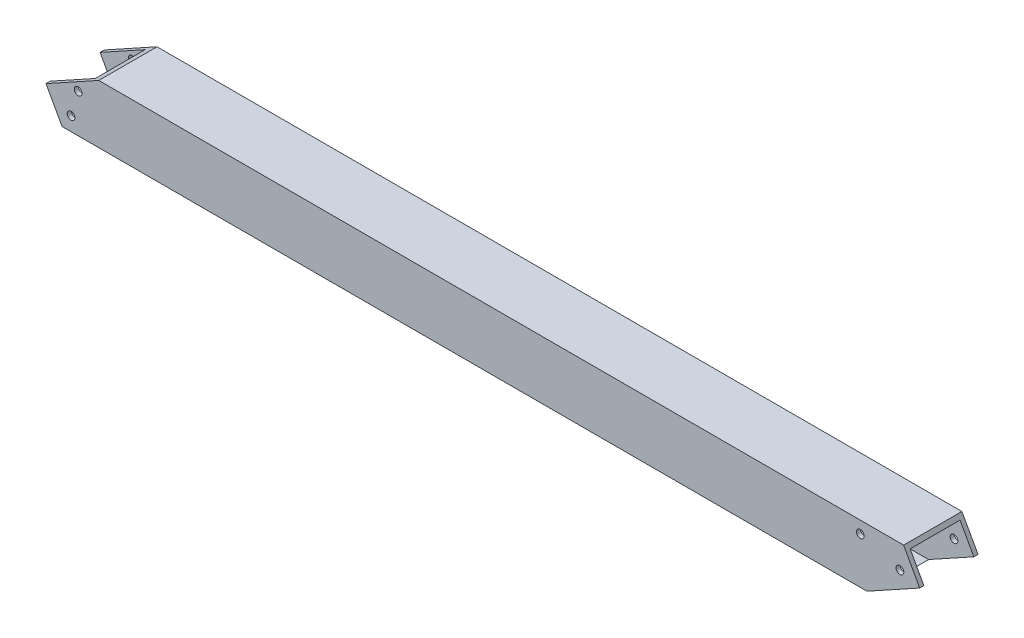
ISO-10303-21;
HEADER;
FILE_DESCRIPTION(('STEP AP214'),'2;1');
FILE_NAME('part.step','',(''),(''),'','','');
FILE_SCHEMA(('AUTOMOTIVE_DESIGN { 1 0 10303 214 1 1 1 1 }'));
ENDSEC;
DATA;
#1=APPLICATION_CONTEXT('core data for automotive mechanical design processes');
#2=APPLICATION_PROTOCOL_DEFINITION('international standard','automotive_design',2000,#1);
#3=PRODUCT_CONTEXT('',#1,'mechanical');
#4=PRODUCT('Part','Part','',(#3));
#5=PRODUCT_RELATED_PRODUCT_CATEGORY('part','',(#4));
#6=PRODUCT_DEFINITION_FORMATION('','',#4);
#7=PRODUCT_DEFINITION_CONTEXT('part definition',#1,'design');
#8=PRODUCT_DEFINITION('design','',#6,#7);
#9=PRODUCT_DEFINITION_SHAPE('','',#8);
#10=(LENGTH_UNIT() NAMED_UNIT(*) SI_UNIT(.MILLI.,.METRE.));
#11=(NAMED_UNIT(*) PLANE_ANGLE_UNIT() SI_UNIT($,.RADIAN.));
#12=(NAMED_UNIT(*) SI_UNIT($,.STERADIAN.) SOLID_ANGLE_UNIT());
#13=UNCERTAINTY_MEASURE_WITH_UNIT(LENGTH_MEASURE(1.E-05),#10,'distance_accuracy_value','');
#14=(GEOMETRIC_REPRESENTATION_CONTEXT(3) GLOBAL_UNCERTAINTY_ASSIGNED_CONTEXT((#13)) GLOBAL_UNIT_ASSIGNED_CONTEXT((#10,
#11,#12)) REPRESENTATION_CONTEXT('',''));
#15=CARTESIAN_POINT('',(0.,0.,0.));
#16=DIRECTION('',(0.,0.,1.));
#17=DIRECTION('',(1.,0.,0.));
#18=AXIS2_PLACEMENT_3D('',#15,#16,#17);
#19=CARTESIAN_POINT('',(3048.,47.1424000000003,-3.65759999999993));
#20=DIRECTION('',(0.,-1.,0.));
#21=DIRECTION('',(0.,0.,-1.));
#22=AXIS2_PLACEMENT_3D('',#19,#20,#21);
#23=PLANE('',#22);
#24=DIRECTION('',(-1.,0.,0.));
#25=VECTOR('',#24,1.);
#26=CARTESIAN_POINT('',(3048.,47.1424000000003,-47.1424));
#27=LINE('',#26,#25);
#28=CARTESIAN_POINT('',(3035.98991238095,47.1424000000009,-47.1424));
#29=VERTEX_POINT('',#28);
#30=CARTESIAN_POINT('',(2325.65233864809,47.1424,-47.1424));
#31=VERTEX_POINT('',#30);
#32=EDGE_CURVE('E194',#29,#31,#27,.T.);
#33=ORIENTED_EDGE('',*,*,#32,.F.);
#34=DIRECTION('',(0.,0.,1.));
#35=VECTOR('',#34,1.);
#36=CARTESIAN_POINT('',(3035.98991238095,47.1424000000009,-3.65759999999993));
#37=LINE('',#36,#35);
#38=CARTESIAN_POINT('',(3035.98991238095,47.1424000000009,-3.65759999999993));
#39=VERTEX_POINT('',#38);
#40=EDGE_CURVE('E215',#29,#39,#37,.T.);
#41=ORIENTED_EDGE('',*,*,#40,.T.);
#42=DIRECTION('',(-1.,0.,0.));
#43=VECTOR('',#42,1.);
#44=CARTESIAN_POINT('',(3048.,47.1424000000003,-3.65759999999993));
#45=LINE('',#44,#43);
#46=CARTESIAN_POINT('',(2325.65233864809,47.1424,-3.65759999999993));
#47=VERTEX_POINT('',#46);
#48=EDGE_CURVE('E191',#39,#47,#45,.T.);
#49=ORIENTED_EDGE('',*,*,#48,.T.);
#50=DIRECTION('',(0.,0.,-1.));
#51=VECTOR('',#50,1.);
#52=CARTESIAN_POINT('',(2325.65233864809,47.1424,-3.65759999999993));
#53=LINE('',#52,#51);
#54=EDGE_CURVE('E212',#47,#31,#53,.T.);
#55=ORIENTED_EDGE('',*,*,#54,.T.);
#56=EDGE_LOOP('',(#33,#41,#49,#55));
#57=FACE_BOUND('',#56,.T.);
#58=ADVANCED_FACE('F30',(#57),#23,.T.);
#59=CARTESIAN_POINT('',(3048.,47.1424000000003,-47.1424));
#60=DIRECTION('',(0.,0.,1.));
#61=DIRECTION('',(0.,-1.,0.));
#62=AXIS2_PLACEMENT_3D('',#59,#60,#61);
#63=PLANE('',#62);
#64=CARTESIAN_POINT('',(2314.32734260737,33.6323173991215,-47.1424));
#65=DIRECTION('',(0.,0.,1.));
#66=DIRECTION('',(0.,-1.,0.));
#67=AXIS2_PLACEMENT_3D('',#64,#65,#66);
#68=CIRCLE('',#67,3.37312000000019);
#69=CARTESIAN_POINT('',(2314.32734260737,30.2591973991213,-47.1424));
#70=VERTEX_POINT('',#69);
#71=EDGE_CURVE('E394',#70,#70,#68,.T.);
#72=ORIENTED_EDGE('',*,*,#71,.F.);
#73=EDGE_LOOP('',(#72));
#74=FACE_BOUND('',#73,.T.);
#75=CARTESIAN_POINT('',(2308.10725809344,12.060534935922,-47.1424));
#76=DIRECTION('',(0.,0.,1.));
#77=DIRECTION('',(0.,-1.,0.));
#78=AXIS2_PLACEMENT_3D('',#75,#76,#77);
#79=CIRCLE('',#78,3.3731200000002);
#80=CARTESIAN_POINT('',(2308.10725809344,8.68741493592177,-47.1424));
#81=VERTEX_POINT('',#80);
#82=EDGE_CURVE('E406',#81,#81,#79,.T.);
#83=ORIENTED_EDGE('',*,*,#82,.F.);
#84=EDGE_LOOP('',(#83));
#85=FACE_BOUND('',#84,.T.);
#86=CARTESIAN_POINT('',(3030.74257402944,30.3760676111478,-47.1424));
#87=DIRECTION('',(0.,0.,1.));
#88=DIRECTION('',(0.,-1.,0.));
#89=AXIS2_PLACEMENT_3D('',#86,#87,#88);
#90=CIRCLE('',#89,3.3731200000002);
#91=CARTESIAN_POINT('',(3030.74257402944,27.0029476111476,-47.1424));
#92=VERTEX_POINT('',#91);
#93=EDGE_CURVE('E418',#92,#92,#90,.T.);
#94=ORIENTED_EDGE('',*,*,#93,.F.);
#95=EDGE_LOOP('',(#94));
#96=FACE_BOUND('',#95,.T.);
#97=CARTESIAN_POINT('',(2996.22772208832,40.3282028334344,-47.1424));
#98=DIRECTION('',(0.,0.,1.));
#99=DIRECTION('',(0.,-1.,0.));
#100=AXIS2_PLACEMENT_3D('',#97,#98,#99);
#101=CIRCLE('',#100,3.37312000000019);
#102=CARTESIAN_POINT('',(2996.22772208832,36.9550828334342,-47.1424));
#103=VERTEX_POINT('',#102);
#104=EDGE_CURVE('E152',#103,#103,#101,.T.);
#105=ORIENTED_EDGE('',*,*,#104,.F.);
#106=EDGE_LOOP('',(#105));
#107=FACE_BOUND('',#106,.T.);
#108=ORIENTED_EDGE('',*,*,#32,.T.);
#109=DIRECTION('',(-0.875334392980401,-0.483518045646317,0.));
#110=VECTOR('',#109,1.);
#111=CARTESIAN_POINT('',(2879.12255662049,352.868806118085,-47.1424));
#112=LINE('',#111,#110);
#113=CARTESIAN_POINT('',(2286.29109726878,25.4000000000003,-47.1424));
#114=VERTEX_POINT('',#113);
#115=EDGE_CURVE('E162',#31,#114,#112,.T.);
#116=ORIENTED_EDGE('',*,*,#115,.T.);
#117=DIRECTION('',(0.483518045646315,-0.875334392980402,0.));
#118=VECTOR('',#117,1.);
#119=CARTESIAN_POINT('',(2455.16854064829,-280.326406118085,-47.1424));
#120=LINE('',#119,#118);
#121=CARTESIAN_POINT('',(2298.30118488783,3.65760000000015,-47.1424));
#122=VERTEX_POINT('',#121);
#123=EDGE_CURVE('E11',#114,#122,#120,.T.);
#124=ORIENTED_EDGE('',*,*,#123,.T.);
#125=DIRECTION('',(-1.,0.,0.));
#126=VECTOR('',#125,1.);
#127=CARTESIAN_POINT('',(3048.,3.65760000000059,-47.1424));
#128=LINE('',#127,#126);
#129=CARTESIAN_POINT('',(3008.63875862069,3.65760000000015,-47.1424));
#130=VERTEX_POINT('',#129);
#131=EDGE_CURVE('E197',#130,#122,#128,.T.);
#132=ORIENTED_EDGE('',*,*,#131,.F.);
#133=DIRECTION('',(0.875334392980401,0.483518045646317,0.));
#134=VECTOR('',#133,1.);
#135=CARTESIAN_POINT('',(3057.20225283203,30.4831491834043,-47.1424));
#136=LINE('',#135,#134);
#137=CARTESIAN_POINT('',(3048.,25.4000000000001,-47.1424));
#138=VERTEX_POINT('',#137);
#139=EDGE_CURVE('E38',#130,#138,#136,.T.);
#140=ORIENTED_EDGE('',*,*,#139,.T.);
#141=DIRECTION('',(-0.483518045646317,0.875334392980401,0.));
#142=VECTOR('',#141,1.);
#143=CARTESIAN_POINT('',(3038.79774716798,42.0592508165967,-47.1424));
#144=LINE('',#143,#142);
#145=EDGE_CURVE('E171',#138,#29,#144,.T.);
#146=ORIENTED_EDGE('',*,*,#145,.T.);
#147=EDGE_LOOP('',(#108,#116,#124,#132,#140,#146));
#148=FACE_BOUND('',#147,.T.);
#149=ADVANCED_FACE('F220',(#74,#85,#96,#107,#148),#63,.T.);
#150=CARTESIAN_POINT('',(3048.,3.65760000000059,-3.65759999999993));
#151=DIRECTION('',(0.,1.,0.));
#152=DIRECTION('',(0.,0.,1.));
#153=AXIS2_PLACEMENT_3D('',#150,#151,#152);
#154=PLANE('',#153);
#155=ORIENTED_EDGE('',*,*,#131,.T.);
#156=DIRECTION('',(0.,0.,1.));
#157=VECTOR('',#156,1.);
#158=CARTESIAN_POINT('',(2298.30118488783,3.65760000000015,-3.65759999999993));
#159=LINE('',#158,#157);
#160=CARTESIAN_POINT('',(2298.30118488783,3.65760000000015,-3.65759999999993));
#161=VERTEX_POINT('',#160);
#162=EDGE_CURVE('E183',#122,#161,#159,.T.);
#163=ORIENTED_EDGE('',*,*,#162,.T.);
#164=DIRECTION('',(-1.,0.,0.));
#165=VECTOR('',#164,1.);
#166=CARTESIAN_POINT('',(3048.,3.65760000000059,-3.65759999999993));
#167=LINE('',#166,#165);
#168=CARTESIAN_POINT('',(3008.63875862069,3.65760000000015,-3.65759999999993));
#169=VERTEX_POINT('',#168);
#170=EDGE_CURVE('E200',#169,#161,#167,.T.);
#171=ORIENTED_EDGE('',*,*,#170,.F.);
#172=DIRECTION('',(0.,0.,-1.));
#173=VECTOR('',#172,1.);
#174=CARTESIAN_POINT('',(3008.63875862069,3.65760000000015,-3.65759999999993));
#175=LINE('',#174,#173);
#176=EDGE_CURVE('E177',#169,#130,#175,.T.);
#177=ORIENTED_EDGE('',*,*,#176,.T.);
#178=EDGE_LOOP('',(#155,#163,#171,#177));
#179=FACE_BOUND('',#178,.T.);
#180=ADVANCED_FACE('F226',(#179),#154,.T.);
#181=CARTESIAN_POINT('',(3048.,47.1424000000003,-3.65759999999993));
#182=DIRECTION('',(0.,0.,-1.));
#183=DIRECTION('',(0.,1.,0.));
#184=AXIS2_PLACEMENT_3D('',#181,#182,#183);
#185=PLANE('',#184);
#186=CARTESIAN_POINT('',(2314.32734260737,33.6323173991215,-3.65759999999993));
#187=DIRECTION('',(0.,0.,-1.));
#188=DIRECTION('',(0.,1.,0.));
#189=AXIS2_PLACEMENT_3D('',#186,#187,#188);
#190=CIRCLE('',#189,3.37312000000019);
#191=CARTESIAN_POINT('',(2314.32734260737,37.0054373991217,-3.65759999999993));
#192=VERTEX_POINT('',#191);
#193=EDGE_CURVE('E384',#192,#192,#190,.T.);
#194=ORIENTED_EDGE('',*,*,#193,.F.);
#195=EDGE_LOOP('',(#194));
#196=FACE_BOUND('',#195,.T.);
#197=CARTESIAN_POINT('',(2308.10725809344,12.060534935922,-3.65759999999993));
#198=DIRECTION('',(0.,0.,-1.));
#199=DIRECTION('',(0.,1.,0.));
#200=AXIS2_PLACEMENT_3D('',#197,#198,#199);
#201=CIRCLE('',#200,3.3731200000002);
#202=CARTESIAN_POINT('',(2308.10725809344,15.4336549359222,-3.65759999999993));
#203=VERTEX_POINT('',#202);
#204=EDGE_CURVE('E401',#203,#203,#201,.T.);
#205=ORIENTED_EDGE('',*,*,#204,.F.);
#206=EDGE_LOOP('',(#205));
#207=FACE_BOUND('',#206,.T.);
#208=CARTESIAN_POINT('',(3030.74257402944,30.3760676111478,-3.65759999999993));
#209=DIRECTION('',(0.,0.,-1.));
#210=DIRECTION('',(0.,1.,0.));
#211=AXIS2_PLACEMENT_3D('',#208,#209,#210);
#212=CIRCLE('',#211,3.3731200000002);
#213=CARTESIAN_POINT('',(3030.74257402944,33.7491876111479,-3.65759999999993));
#214=VERTEX_POINT('',#213);
#215=EDGE_CURVE('E413',#214,#214,#212,.T.);
#216=ORIENTED_EDGE('',*,*,#215,.F.);
#217=EDGE_LOOP('',(#216));
#218=FACE_BOUND('',#217,.T.);
#219=CARTESIAN_POINT('',(2996.22772208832,40.3282028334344,-3.65759999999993));
#220=DIRECTION('',(0.,0.,-1.));
#221=DIRECTION('',(0.,1.,0.));
#222=AXIS2_PLACEMENT_3D('',#219,#220,#221);
#223=CIRCLE('',#222,3.37312000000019);
#224=CARTESIAN_POINT('',(2996.22772208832,43.7013228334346,-3.65759999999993));
#225=VERTEX_POINT('',#224);
#226=EDGE_CURVE('E425',#225,#225,#223,.T.);
#227=ORIENTED_EDGE('',*,*,#226,.F.);
#228=EDGE_LOOP('',(#227));
#229=FACE_BOUND('',#228,.T.);
#230=DIRECTION('',(-0.483518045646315,0.875334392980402,0.));
#231=VECTOR('',#230,1.);
#232=CARTESIAN_POINT('',(2455.16854064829,-280.326406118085,-3.65759999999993));
#233=LINE('',#232,#231);
#234=CARTESIAN_POINT('',(2286.29109726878,25.4000000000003,-3.65759999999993));
#235=VERTEX_POINT('',#234);
#236=EDGE_CURVE('E186',#161,#235,#233,.T.);
#237=ORIENTED_EDGE('',*,*,#236,.T.);
#238=DIRECTION('',(0.875334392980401,0.483518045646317,0.));
#239=VECTOR('',#238,1.);
#240=CARTESIAN_POINT('',(2879.12255662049,352.868806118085,-3.65759999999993));
#241=LINE('',#240,#239);
#242=EDGE_CURVE('E166',#235,#47,#241,.T.);
#243=ORIENTED_EDGE('',*,*,#242,.T.);
#244=ORIENTED_EDGE('',*,*,#48,.F.);
#245=DIRECTION('',(0.483518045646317,-0.875334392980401,0.));
#246=VECTOR('',#245,1.);
#247=CARTESIAN_POINT('',(3038.79774716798,42.0592508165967,-3.65759999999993));
#248=LINE('',#247,#246);
#249=CARTESIAN_POINT('',(3048.,25.4000000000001,-3.65759999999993));
#250=VERTEX_POINT('',#249);
#251=EDGE_CURVE('E174',#39,#250,#248,.T.);
#252=ORIENTED_EDGE('',*,*,#251,.T.);
#253=DIRECTION('',(-0.875334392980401,-0.483518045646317,0.));
#254=VECTOR('',#253,1.);
#255=CARTESIAN_POINT('',(3057.20225283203,30.4831491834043,-3.65759999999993));
#256=LINE('',#255,#254);
#257=EDGE_CURVE('E136',#250,#169,#256,.T.);
#258=ORIENTED_EDGE('',*,*,#257,.T.);
#259=ORIENTED_EDGE('',*,*,#170,.T.);
#260=EDGE_LOOP('',(#237,#243,#244,#252,#258,#259));
#261=FACE_BOUND('',#260,.T.);
#262=ADVANCED_FACE('F228',(#196,#207,#218,#229,#261),#185,.T.);
#263=CARTESIAN_POINT('',(2286.29109726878,25.4000000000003,0.));
#264=DIRECTION('',(-0.483518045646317,0.875334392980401,0.));
#265=DIRECTION('',(-0.875334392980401,-0.483518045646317,0.));
#266=AXIS2_PLACEMENT_3D('',#263,#264,#265);
#267=PLANE('',#266);
#268=DIRECTION('',(0.,0.,-1.));
#269=VECTOR('',#268,1.);
#270=CARTESIAN_POINT('',(2332.27385588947,50.7999999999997,0.));
#271=LINE('',#270,#269);
#272=CARTESIAN_POINT('',(2332.27385588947,50.7999999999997,0.));
#273=VERTEX_POINT('',#272);
#274=CARTESIAN_POINT('',(2332.27385588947,50.8000000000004,-50.8));
#275=VERTEX_POINT('',#274);
#276=EDGE_CURVE('E169',#273,#275,#271,.T.);
#277=ORIENTED_EDGE('',*,*,#276,.T.);
#278=DIRECTION('',(0.875334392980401,0.483518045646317,0.));
#279=VECTOR('',#278,1.);
#280=CARTESIAN_POINT('',(2286.29109726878,25.4000000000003,-50.8));
#281=LINE('',#280,#279);
#282=CARTESIAN_POINT('',(2286.29109726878,25.4000000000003,-50.8));
#283=VERTEX_POINT('',#282);
#284=EDGE_CURVE('E130',#283,#275,#281,.T.);
#285=ORIENTED_EDGE('',*,*,#284,.F.);
#286=DIRECTION('',(0.,0.,-1.));
#287=VECTOR('',#286,1.);
#288=CARTESIAN_POINT('',(2286.29109726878,25.4000000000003,0.));
#289=LINE('',#288,#287);
#290=EDGE_CURVE('E137',#114,#283,#289,.T.);
#291=ORIENTED_EDGE('',*,*,#290,.F.);
#292=ORIENTED_EDGE('',*,*,#115,.F.);
#293=ORIENTED_EDGE('',*,*,#54,.F.);
#294=ORIENTED_EDGE('',*,*,#242,.F.);
#295=CARTESIAN_POINT('',(2286.29109726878,25.4000000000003,0.));
#296=VERTEX_POINT('',#295);
#297=EDGE_CURVE('E160',#296,#235,#289,.T.);
#298=ORIENTED_EDGE('',*,*,#297,.F.);
#299=DIRECTION('',(0.875334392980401,0.483518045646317,0.));
#300=VECTOR('',#299,1.);
#301=CARTESIAN_POINT('',(2286.29109726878,25.4000000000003,0.));
#302=LINE('',#301,#300);
#303=EDGE_CURVE('E53',#296,#273,#302,.T.);
#304=ORIENTED_EDGE('',*,*,#303,.T.);
#305=EDGE_LOOP('',(#277,#285,#291,#292,#293,#294,#298,#304));
#306=FACE_BOUND('',#305,.T.);
#307=ADVANCED_FACE('F232',(#306),#267,.T.);
#308=CARTESIAN_POINT('',(2464.37079348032,-296.985656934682,0.));
#309=DIRECTION('',(-0.875334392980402,-0.483518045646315,0.));
#310=DIRECTION('',(0.483518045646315,-0.875334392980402,0.));
#311=AXIS2_PLACEMENT_3D('',#308,#309,#310);
#312=PLANE('',#311);
#313=DIRECTION('',(0.,0.,1.));
#314=VECTOR('',#313,1.);
#315=CARTESIAN_POINT('',(2300.32157345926,0.,0.));
#316=LINE('',#315,#314);
#317=CARTESIAN_POINT('',(2300.32157345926,0.,-50.8));
#318=VERTEX_POINT('',#317);
#319=CARTESIAN_POINT('',(2300.32157345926,0.,0.));
#320=VERTEX_POINT('',#319);
#321=EDGE_CURVE('E189',#318,#320,#316,.T.);
#322=ORIENTED_EDGE('',*,*,#321,.T.);
#323=DIRECTION('',(-0.483518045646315,0.875334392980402,0.));
#324=VECTOR('',#323,1.);
#325=CARTESIAN_POINT('',(2464.37079348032,-296.985656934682,0.));
#326=LINE('',#325,#324);
#327=EDGE_CURVE('E144',#320,#296,#326,.T.);
#328=ORIENTED_EDGE('',*,*,#327,.T.);
#329=ORIENTED_EDGE('',*,*,#297,.T.);
#330=ORIENTED_EDGE('',*,*,#236,.F.);
#331=ORIENTED_EDGE('',*,*,#162,.F.);
#332=ORIENTED_EDGE('',*,*,#123,.F.);
#333=ORIENTED_EDGE('',*,*,#290,.T.);
#334=DIRECTION('',(-0.483518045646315,0.875334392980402,0.));
#335=VECTOR('',#334,1.);
#336=CARTESIAN_POINT('',(2464.37079348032,-296.985656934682,-50.8));
#337=LINE('',#336,#335);
#338=EDGE_CURVE('E155',#318,#283,#337,.T.);
#339=ORIENTED_EDGE('',*,*,#338,.F.);
#340=EDGE_LOOP('',(#322,#328,#329,#330,#331,#332,#333,#339));
#341=FACE_BOUND('',#340,.T.);
#342=ADVANCED_FACE('F235',(#341),#312,.T.);
#343=CARTESIAN_POINT('',(3048.,25.4000000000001,0.));
#344=DIRECTION('',(0.483518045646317,-0.875334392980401,0.));
#345=DIRECTION('',(0.875334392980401,0.483518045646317,0.));
#346=AXIS2_PLACEMENT_3D('',#343,#344,#345);
#347=PLANE('',#346);
#348=DIRECTION('',(0.,0.,-1.));
#349=VECTOR('',#348,1.);
#350=CARTESIAN_POINT('',(3002.01724137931,2.22044604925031E-13,0.));
#351=LINE('',#350,#349);
#352=CARTESIAN_POINT('',(3002.01724137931,2.22044604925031E-13,0.));
#353=VERTEX_POINT('',#352);
#354=CARTESIAN_POINT('',(3002.01724137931,2.22044604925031E-13,-50.8));
#355=VERTEX_POINT('',#354);
#356=EDGE_CURVE('E181',#353,#355,#351,.T.);
#357=ORIENTED_EDGE('',*,*,#356,.T.);
#358=DIRECTION('',(-0.875334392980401,-0.483518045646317,0.));
#359=VECTOR('',#358,1.);
#360=CARTESIAN_POINT('',(3048.,25.4000000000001,-50.8));
#361=LINE('',#360,#359);
#362=CARTESIAN_POINT('',(3048.,25.4000000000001,-50.8));
#363=VERTEX_POINT('',#362);
#364=EDGE_CURVE('E151',#363,#355,#361,.T.);
#365=ORIENTED_EDGE('',*,*,#364,.F.);
#366=DIRECTION('',(0.,0.,-1.));
#367=VECTOR('',#366,1.);
#368=CARTESIAN_POINT('',(3048.,25.4000000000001,0.));
#369=LINE('',#368,#367);
#370=EDGE_CURVE('E138',#138,#363,#369,.T.);
#371=ORIENTED_EDGE('',*,*,#370,.F.);
#372=ORIENTED_EDGE('',*,*,#139,.F.);
#373=ORIENTED_EDGE('',*,*,#176,.F.);
#374=ORIENTED_EDGE('',*,*,#257,.F.);
#375=CARTESIAN_POINT('',(3048.,25.4000000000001,0.));
#376=VERTEX_POINT('',#375);
#377=EDGE_CURVE('E122',#376,#250,#369,.T.);
#378=ORIENTED_EDGE('',*,*,#377,.F.);
#379=DIRECTION('',(-0.875334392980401,-0.483518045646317,0.));
#380=VECTOR('',#379,1.);
#381=CARTESIAN_POINT('',(3048.,25.4000000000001,0.));
#382=LINE('',#381,#380);
#383=EDGE_CURVE('E129',#376,#353,#382,.T.);
#384=ORIENTED_EDGE('',*,*,#383,.T.);
#385=EDGE_LOOP('',(#357,#365,#371,#372,#373,#374,#378,#384));
#386=FACE_BOUND('',#385,.T.);
#387=ADVANCED_FACE('F133',(#386),#347,.T.);
#388=CARTESIAN_POINT('',(3048.,25.4000000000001,0.));
#389=DIRECTION('',(0.875334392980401,0.483518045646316,0.));
#390=DIRECTION('',(-0.483518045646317,0.875334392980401,0.));
#391=AXIS2_PLACEMENT_3D('',#388,#389,#390);
#392=PLANE('',#391);
#393=DIRECTION('',(0.,0.,1.));
#394=VECTOR('',#393,1.);
#395=CARTESIAN_POINT('',(3033.96952380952,50.8000000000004,0.));
#396=LINE('',#395,#394);
#397=CARTESIAN_POINT('',(3033.96952380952,50.8000000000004,-50.8));
#398=VERTEX_POINT('',#397);
#399=CARTESIAN_POINT('',(3033.96952380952,50.8000000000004,0.));
#400=VERTEX_POINT('',#399);
#401=EDGE_CURVE('E124',#398,#400,#396,.T.);
#402=ORIENTED_EDGE('',*,*,#401,.T.);
#403=DIRECTION('',(0.483518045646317,-0.875334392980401,0.));
#404=VECTOR('',#403,1.);
#405=CARTESIAN_POINT('',(3048.,25.4000000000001,0.));
#406=LINE('',#405,#404);
#407=EDGE_CURVE('E119',#400,#376,#406,.T.);
#408=ORIENTED_EDGE('',*,*,#407,.T.);
#409=ORIENTED_EDGE('',*,*,#377,.T.);
#410=ORIENTED_EDGE('',*,*,#251,.F.);
#411=ORIENTED_EDGE('',*,*,#40,.F.);
#412=ORIENTED_EDGE('',*,*,#145,.F.);
#413=ORIENTED_EDGE('',*,*,#370,.T.);
#414=DIRECTION('',(0.483518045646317,-0.875334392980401,0.));
#415=VECTOR('',#414,1.);
#416=CARTESIAN_POINT('',(3048.,25.4000000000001,-50.8));
#417=LINE('',#416,#415);
#418=EDGE_CURVE('E45',#398,#363,#417,.T.);
#419=ORIENTED_EDGE('',*,*,#418,.F.);
#420=EDGE_LOOP('',(#402,#408,#409,#410,#411,#412,#413,#419));
#421=FACE_BOUND('',#420,.T.);
#422=ADVANCED_FACE('F121',(#421),#392,.T.);
#423=CARTESIAN_POINT('',(3048.,2.22044604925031E-13,0.));
#424=DIRECTION('',(0.,0.,-1.));
#425=DIRECTION('',(-1.,0.,0.));
#426=AXIS2_PLACEMENT_3D('',#423,#424,#425);
#427=PLANE('',#426);
#428=CARTESIAN_POINT('',(2314.32734260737,33.6323173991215,0.));
#429=DIRECTION('',(0.,0.,1.));
#430=DIRECTION('',(1.,0.,0.));
#431=AXIS2_PLACEMENT_3D('',#428,#429,#430);
#432=CIRCLE('',#431,3.37312000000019);
#433=CARTESIAN_POINT('',(2317.70046260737,33.6323173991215,0.));
#434=VERTEX_POINT('',#433);
#435=EDGE_CURVE('E387',#434,#434,#432,.T.);
#436=ORIENTED_EDGE('',*,*,#435,.F.);
#437=EDGE_LOOP('',(#436));
#438=FACE_BOUND('',#437,.T.);
#439=CARTESIAN_POINT('',(2308.10725809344,12.060534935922,0.));
#440=DIRECTION('',(0.,0.,1.));
#441=DIRECTION('',(1.,0.,0.));
#442=AXIS2_PLACEMENT_3D('',#439,#440,#441);
#443=CIRCLE('',#442,3.3731200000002);
#444=CARTESIAN_POINT('',(2311.48037809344,12.060534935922,0.));
#445=VERTEX_POINT('',#444);
#446=EDGE_CURVE('E397',#445,#445,#443,.T.);
#447=ORIENTED_EDGE('',*,*,#446,.F.);
#448=EDGE_LOOP('',(#447));
#449=FACE_BOUND('',#448,.T.);
#450=CARTESIAN_POINT('',(3030.74257402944,30.3760676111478,0.));
#451=DIRECTION('',(0.,0.,1.));
#452=DIRECTION('',(1.,0.,0.));
#453=AXIS2_PLACEMENT_3D('',#450,#451,#452);
#454=CIRCLE('',#453,3.3731200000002);
#455=CARTESIAN_POINT('',(3034.11569402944,30.3760676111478,0.));
#456=VERTEX_POINT('',#455);
#457=EDGE_CURVE('E409',#456,#456,#454,.T.);
#458=ORIENTED_EDGE('',*,*,#457,.F.);
#459=EDGE_LOOP('',(#458));
#460=FACE_BOUND('',#459,.T.);
#461=CARTESIAN_POINT('',(2996.22772208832,40.3282028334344,0.));
#462=DIRECTION('',(0.,0.,1.));
#463=DIRECTION('',(1.,0.,0.));
#464=AXIS2_PLACEMENT_3D('',#461,#462,#463);
#465=CIRCLE('',#464,3.37312000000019);
#466=CARTESIAN_POINT('',(2999.60084208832,40.3282028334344,0.));
#467=VERTEX_POINT('',#466);
#468=EDGE_CURVE('E421',#467,#467,#465,.T.);
#469=ORIENTED_EDGE('',*,*,#468,.F.);
#470=EDGE_LOOP('',(#469));
#471=FACE_BOUND('',#470,.T.);
#472=ORIENTED_EDGE('',*,*,#303,.F.);
#473=ORIENTED_EDGE('',*,*,#327,.F.);
#474=DIRECTION('',(-1.,0.,0.));
#475=VECTOR('',#474,1.);
#476=CARTESIAN_POINT('',(3048.,2.22044604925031E-13,0.));
#477=LINE('',#476,#475);
#478=EDGE_CURVE('E143',#353,#320,#477,.T.);
#479=ORIENTED_EDGE('',*,*,#478,.F.);
#480=ORIENTED_EDGE('',*,*,#383,.F.);
#481=ORIENTED_EDGE('',*,*,#407,.F.);
#482=DIRECTION('',(-1.,0.,0.));
#483=VECTOR('',#482,1.);
#484=CARTESIAN_POINT('',(3048.,50.8000000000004,0.));
#485=LINE('',#484,#483);
#486=EDGE_CURVE('E203',#400,#273,#485,.T.);
#487=ORIENTED_EDGE('',*,*,#486,.T.);
#488=EDGE_LOOP('',(#472,#473,#479,#480,#481,#487));
#489=FACE_BOUND('',#488,.T.);
#490=ADVANCED_FACE('F32',(#438,#449,#460,#471,#489),#427,.F.);
#491=CARTESIAN_POINT('',(3048.,2.22044604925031E-13,0.));
#492=DIRECTION('',(0.,1.,0.));
#493=DIRECTION('',(0.,0.,1.));
#494=AXIS2_PLACEMENT_3D('',#491,#492,#493);
#495=PLANE('',#494);
#496=ORIENTED_EDGE('',*,*,#321,.F.);
#497=DIRECTION('',(-1.,0.,0.));
#498=VECTOR('',#497,1.);
#499=CARTESIAN_POINT('',(3048.,2.22044604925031E-13,-50.8));
#500=LINE('',#499,#498);
#501=EDGE_CURVE('E208',#355,#318,#500,.T.);
#502=ORIENTED_EDGE('',*,*,#501,.F.);
#503=ORIENTED_EDGE('',*,*,#356,.F.);
#504=ORIENTED_EDGE('',*,*,#478,.T.);
#505=EDGE_LOOP('',(#496,#502,#503,#504));
#506=FACE_BOUND('',#505,.T.);
#507=ADVANCED_FACE('F244',(#506),#495,.F.);
#508=CARTESIAN_POINT('',(3048.,2.22044604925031E-13,-50.8));
#509=DIRECTION('',(0.,0.,1.));
#510=DIRECTION('',(1.,0.,0.));
#511=AXIS2_PLACEMENT_3D('',#508,#509,#510);
#512=PLANE('',#511);
#513=CARTESIAN_POINT('',(2314.32734260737,33.6323173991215,-50.8));
#514=DIRECTION('',(0.,0.,1.));
#515=DIRECTION('',(1.,0.,0.));
#516=AXIS2_PLACEMENT_3D('',#513,#514,#515);
#517=CIRCLE('',#516,3.37312000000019);
#518=CARTESIAN_POINT('',(2317.70046260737,33.6323173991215,-50.8));
#519=VERTEX_POINT('',#518);
#520=EDGE_CURVE('E388',#519,#519,#517,.T.);
#521=ORIENTED_EDGE('',*,*,#520,.T.);
#522=EDGE_LOOP('',(#521));
#523=FACE_BOUND('',#522,.T.);
#524=CARTESIAN_POINT('',(2308.10725809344,12.060534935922,-50.8));
#525=DIRECTION('',(0.,0.,1.));
#526=DIRECTION('',(1.,0.,0.));
#527=AXIS2_PLACEMENT_3D('',#524,#525,#526);
#528=CIRCLE('',#527,3.3731200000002);
#529=CARTESIAN_POINT('',(2311.48037809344,12.060534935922,-50.8));
#530=VERTEX_POINT('',#529);
#531=EDGE_CURVE('E398',#530,#530,#528,.T.);
#532=ORIENTED_EDGE('',*,*,#531,.T.);
#533=EDGE_LOOP('',(#532));
#534=FACE_BOUND('',#533,.T.);
#535=CARTESIAN_POINT('',(3030.74257402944,30.3760676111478,-50.8));
#536=DIRECTION('',(0.,0.,1.));
#537=DIRECTION('',(1.,0.,0.));
#538=AXIS2_PLACEMENT_3D('',#535,#536,#537);
#539=CIRCLE('',#538,3.3731200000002);
#540=CARTESIAN_POINT('',(3034.11569402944,30.3760676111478,-50.8));
#541=VERTEX_POINT('',#540);
#542=EDGE_CURVE('E410',#541,#541,#539,.T.);
#543=ORIENTED_EDGE('',*,*,#542,.T.);
#544=EDGE_LOOP('',(#543));
#545=FACE_BOUND('',#544,.T.);
#546=CARTESIAN_POINT('',(2996.22772208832,40.3282028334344,-50.8));
#547=DIRECTION('',(0.,0.,1.));
#548=DIRECTION('',(1.,0.,0.));
#549=AXIS2_PLACEMENT_3D('',#546,#547,#548);
#550=CIRCLE('',#549,3.37312000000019);
#551=CARTESIAN_POINT('',(2999.60084208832,40.3282028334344,-50.8));
#552=VERTEX_POINT('',#551);
#553=EDGE_CURVE('E422',#552,#552,#550,.T.);
#554=ORIENTED_EDGE('',*,*,#553,.T.);
#555=EDGE_LOOP('',(#554));
#556=FACE_BOUND('',#555,.T.);
#557=ORIENTED_EDGE('',*,*,#284,.T.);
#558=DIRECTION('',(-1.,0.,0.));
#559=VECTOR('',#558,1.);
#560=CARTESIAN_POINT('',(3048.,50.8000000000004,-50.8));
#561=LINE('',#560,#559);
#562=EDGE_CURVE('E205',#398,#275,#561,.T.);
#563=ORIENTED_EDGE('',*,*,#562,.F.);
#564=ORIENTED_EDGE('',*,*,#418,.T.);
#565=ORIENTED_EDGE('',*,*,#364,.T.);
#566=ORIENTED_EDGE('',*,*,#501,.T.);
#567=ORIENTED_EDGE('',*,*,#338,.T.);
#568=EDGE_LOOP('',(#557,#563,#564,#565,#566,#567));
#569=FACE_BOUND('',#568,.T.);
#570=ADVANCED_FACE('F241',(#523,#534,#545,#556,#569),#512,.F.);
#571=CARTESIAN_POINT('',(3048.,50.8000000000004,0.));
#572=DIRECTION('',(0.,-1.,0.));
#573=DIRECTION('',(0.,0.,-1.));
#574=AXIS2_PLACEMENT_3D('',#571,#572,#573);
#575=PLANE('',#574);
#576=ORIENTED_EDGE('',*,*,#401,.F.);
#577=ORIENTED_EDGE('',*,*,#562,.T.);
#578=ORIENTED_EDGE('',*,*,#276,.F.);
#579=ORIENTED_EDGE('',*,*,#486,.F.);
#580=EDGE_LOOP('',(#576,#577,#578,#579));
#581=FACE_BOUND('',#580,.T.);
#582=ADVANCED_FACE('F238',(#581),#575,.F.);
#583=CARTESIAN_POINT('',(2996.22772208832,40.3282028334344,-50.8));
#584=DIRECTION('',(0.,0.,1.));
#585=DIRECTION('',(1.,0.,0.));
#586=AXIS2_PLACEMENT_3D('',#583,#584,#585);
#587=CYLINDRICAL_SURFACE('',#586,3.37312000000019);
#588=ORIENTED_EDGE('',*,*,#104,.T.);
#589=EDGE_LOOP('',(#588));
#590=FACE_BOUND('',#589,.T.);
#591=ORIENTED_EDGE('',*,*,#553,.F.);
#592=EDGE_LOOP('',(#591));
#593=FACE_BOUND('',#592,.T.);
#594=ADVANCED_FACE('F269',(#590,#593),#587,.F.);
#595=ORIENTED_EDGE('',*,*,#226,.T.);
#596=EDGE_LOOP('',(#595));
#597=FACE_BOUND('',#596,.T.);
#598=ORIENTED_EDGE('',*,*,#468,.T.);
#599=EDGE_LOOP('',(#598));
#600=FACE_BOUND('',#599,.T.);
#601=ADVANCED_FACE('F273',(#597,#600),#587,.F.);
#602=CARTESIAN_POINT('',(3030.74257402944,30.3760676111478,-50.8));
#603=DIRECTION('',(0.,0.,1.));
#604=DIRECTION('',(1.,0.,0.));
#605=AXIS2_PLACEMENT_3D('',#602,#603,#604);
#606=CYLINDRICAL_SURFACE('',#605,3.3731200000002);
#607=ORIENTED_EDGE('',*,*,#93,.T.);
#608=EDGE_LOOP('',(#607));
#609=FACE_BOUND('',#608,.T.);
#610=ORIENTED_EDGE('',*,*,#542,.F.);
#611=EDGE_LOOP('',(#610));
#612=FACE_BOUND('',#611,.T.);
#613=ADVANCED_FACE('F279',(#609,#612),#606,.F.);
#614=ORIENTED_EDGE('',*,*,#215,.T.);
#615=EDGE_LOOP('',(#614));
#616=FACE_BOUND('',#615,.T.);
#617=ORIENTED_EDGE('',*,*,#457,.T.);
#618=EDGE_LOOP('',(#617));
#619=FACE_BOUND('',#618,.T.);
#620=ADVANCED_FACE('F285',(#616,#619),#606,.F.);
#621=CARTESIAN_POINT('',(2308.10725809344,12.060534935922,-50.8));
#622=DIRECTION('',(0.,0.,1.));
#623=DIRECTION('',(1.,0.,0.));
#624=AXIS2_PLACEMENT_3D('',#621,#622,#623);
#625=CYLINDRICAL_SURFACE('',#624,3.3731200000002);
#626=ORIENTED_EDGE('',*,*,#82,.T.);
#627=EDGE_LOOP('',(#626));
#628=FACE_BOUND('',#627,.T.);
#629=ORIENTED_EDGE('',*,*,#531,.F.);
#630=EDGE_LOOP('',(#629));
#631=FACE_BOUND('',#630,.T.);
#632=ADVANCED_FACE('F351',(#628,#631),#625,.F.);
#633=ORIENTED_EDGE('',*,*,#204,.T.);
#634=EDGE_LOOP('',(#633));
#635=FACE_BOUND('',#634,.T.);
#636=ORIENTED_EDGE('',*,*,#446,.T.);
#637=EDGE_LOOP('',(#636));
#638=FACE_BOUND('',#637,.T.);
#639=ADVANCED_FACE('F358',(#635,#638),#625,.F.);
#640=CARTESIAN_POINT('',(2314.32734260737,33.6323173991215,-50.8));
#641=DIRECTION('',(0.,0.,1.));
#642=DIRECTION('',(1.,0.,0.));
#643=AXIS2_PLACEMENT_3D('',#640,#641,#642);
#644=CYLINDRICAL_SURFACE('',#643,3.37312000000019);
#645=ORIENTED_EDGE('',*,*,#71,.T.);
#646=EDGE_LOOP('',(#645));
#647=FACE_BOUND('',#646,.T.);
#648=ORIENTED_EDGE('',*,*,#520,.F.);
#649=EDGE_LOOP('',(#648));
#650=FACE_BOUND('',#649,.T.);
#651=ADVANCED_FACE('F365',(#647,#650),#644,.F.);
#652=ORIENTED_EDGE('',*,*,#193,.T.);
#653=EDGE_LOOP('',(#652));
#654=FACE_BOUND('',#653,.T.);
#655=ORIENTED_EDGE('',*,*,#435,.T.);
#656=EDGE_LOOP('',(#655));
#657=FACE_BOUND('',#656,.T.);
#658=ADVANCED_FACE('F372',(#654,#657),#644,.F.);
#659=CLOSED_SHELL('',(#58,#149,#180,#262,#307,#342,#387,#422,#490,#507,#570,#582,#594,#601,#613,
#620,#632,#639,#651,#658));
#660=MANIFOLD_SOLID_BREP('B2',#659);
#661=ADVANCED_BREP_SHAPE_REPRESENTATION('',(#18,#660),#14);
#662=SHAPE_DEFINITION_REPRESENTATION(#9,#661);
ENDSEC;
END-ISO-10303-21;
